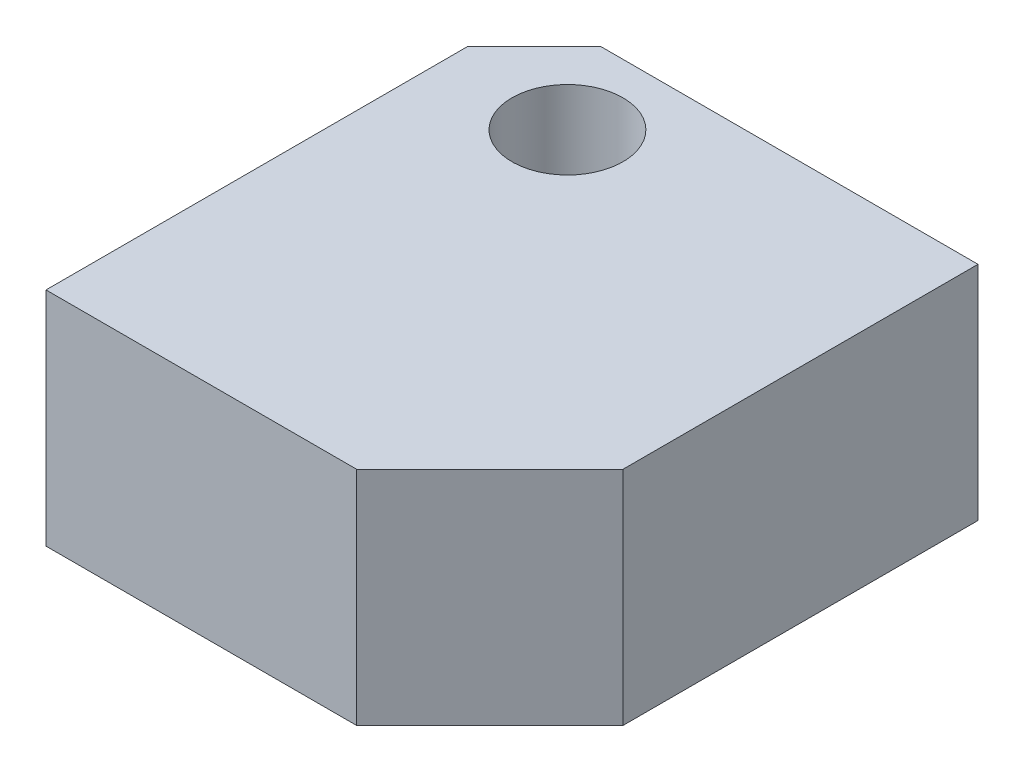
ISO-10303-21;
HEADER;
FILE_DESCRIPTION(('STEP AP214'),'2;1');
FILE_NAME('part.step','',(''),(''),'','','');
FILE_SCHEMA(('AUTOMOTIVE_DESIGN { 1 0 10303 214 1 1 1 1 }'));
ENDSEC;
DATA;
#1=APPLICATION_CONTEXT('core data for automotive mechanical design processes');
#2=APPLICATION_PROTOCOL_DEFINITION('international standard','automotive_design',2000,#1);
#3=PRODUCT_CONTEXT('',#1,'mechanical');
#4=PRODUCT('Part','Part','',(#3));
#5=PRODUCT_RELATED_PRODUCT_CATEGORY('part','',(#4));
#6=PRODUCT_DEFINITION_FORMATION('','',#4);
#7=PRODUCT_DEFINITION_CONTEXT('part definition',#1,'design');
#8=PRODUCT_DEFINITION('design','',#6,#7);
#9=PRODUCT_DEFINITION_SHAPE('','',#8);
#10=(LENGTH_UNIT() NAMED_UNIT(*) SI_UNIT(.MILLI.,.METRE.));
#11=(NAMED_UNIT(*) PLANE_ANGLE_UNIT() SI_UNIT($,.RADIAN.));
#12=(NAMED_UNIT(*) SI_UNIT($,.STERADIAN.) SOLID_ANGLE_UNIT());
#13=UNCERTAINTY_MEASURE_WITH_UNIT(LENGTH_MEASURE(1.E-05),#10,'distance_accuracy_value','');
#14=(GEOMETRIC_REPRESENTATION_CONTEXT(3) GLOBAL_UNCERTAINTY_ASSIGNED_CONTEXT((#13)) GLOBAL_UNIT_ASSIGNED_CONTEXT((#10,
#11,#12)) REPRESENTATION_CONTEXT('',''));
#15=CARTESIAN_POINT('',(0.,0.,0.));
#16=DIRECTION('',(0.,0.,1.));
#17=DIRECTION('',(1.,0.,0.));
#18=AXIS2_PLACEMENT_3D('',#15,#16,#17);
#19=CARTESIAN_POINT('',(15.5000000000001,4.99999999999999,-13.9999999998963));
#20=DIRECTION('',(0.,0.,-1.));
#21=DIRECTION('',(0.,1.,0.));
#22=AXIS2_PLACEMENT_3D('',#19,#20,#21);
#23=CONICAL_SURFACE('',#22,1.99999999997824,1.02974425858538);
#24=CARTESIAN_POINT('',(15.5000000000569,4.99999999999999,-12.7982787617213));
#25=VERTEX_POINT('',#24);
#26=VERTEX_LOOP('',#25);
#27=FACE_BOUND('',#26,.T.);
#28=CARTESIAN_POINT('',(15.5000000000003,4.99999999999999,-14.));
#29=DIRECTION('',(0.,0.,-1.));
#30=DIRECTION('',(0.,1.,0.));
#31=AXIS2_PLACEMENT_3D('',#28,#29,#30);
#32=CIRCLE('',#31,2.);
#33=CARTESIAN_POINT('',(15.5000000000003,6.99999999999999,-14.));
#34=VERTEX_POINT('',#33);
#35=EDGE_CURVE('E77',#34,#34,#32,.T.);
#36=ORIENTED_EDGE('',*,*,#35,.T.);
#37=EDGE_LOOP('',(#36));
#38=FACE_BOUND('',#37,.T.);
#39=ADVANCED_FACE('F16',(#27,#38),#23,.F.);
#40=CARTESIAN_POINT('',(15.5000000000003,4.99999999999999,-12.33819270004));
#41=DIRECTION('',(0.,0.,-1.));
#42=DIRECTION('',(0.,1.,0.));
#43=AXIS2_PLACEMENT_3D('',#40,#41,#42);
#44=CYLINDRICAL_SURFACE('',#43,2.);
#45=ORIENTED_EDGE('',*,*,#35,.F.);
#46=EDGE_LOOP('',(#45));
#47=FACE_BOUND('',#46,.T.);
#48=CARTESIAN_POINT('',(15.5000000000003,4.99999999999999,-22.));
#49=DIRECTION('',(0.,0.,-1.));
#50=DIRECTION('',(0.,1.,0.));
#51=AXIS2_PLACEMENT_3D('',#48,#49,#50);
#52=CIRCLE('',#51,2.);
#53=CARTESIAN_POINT('',(15.5000000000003,6.99999999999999,-22.));
#54=VERTEX_POINT('',#53);
#55=EDGE_CURVE('E88',#54,#54,#52,.F.);
#56=ORIENTED_EDGE('',*,*,#55,.F.);
#57=EDGE_LOOP('',(#56));
#58=FACE_BOUND('',#57,.T.);
#59=ADVANCED_FACE('F74',(#47,#58),#44,.F.);
#60=CARTESIAN_POINT('',(0.,9.99999999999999,0.));
#61=DIRECTION('',(0.,1.,0.));
#62=DIRECTION('',(-1.,0.,0.));
#63=AXIS2_PLACEMENT_3D('',#60,#61,#62);
#64=PLANE('',#63);
#65=DIRECTION('',(1.,0.,0.));
#66=VECTOR('',#65,1.);
#67=CARTESIAN_POINT('',(20.,9.99999999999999,-22.));
#68=LINE('',#67,#66);
#69=CARTESIAN_POINT('',(3.00000000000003,9.99999999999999,-22.));
#70=VERTEX_POINT('',#69);
#71=CARTESIAN_POINT('',(20.,9.99999999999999,-22.));
#72=VERTEX_POINT('',#71);
#73=EDGE_CURVE('E94',#70,#72,#68,.T.);
#74=ORIENTED_EDGE('',*,*,#73,.F.);
#75=DIRECTION('',(-0.707106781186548,0.,0.707106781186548));
#76=VECTOR('',#75,1.);
#77=CARTESIAN_POINT('',(3.,10.,-21.9999999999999));
#78=LINE('',#77,#76);
#79=CARTESIAN_POINT('',(2.91433543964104E-13,9.99999999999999,-18.9999999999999));
#80=VERTEX_POINT('',#79);
#81=EDGE_CURVE('E87',#80,#70,#78,.F.);
#82=ORIENTED_EDGE('',*,*,#81,.F.);
#83=DIRECTION('',(0.,0.,1.));
#84=VECTOR('',#83,1.);
#85=CARTESIAN_POINT('',(3.33066907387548E-13,9.99999999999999,-18.9999999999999));
#86=LINE('',#85,#84);
#87=CARTESIAN_POINT('',(2.49800180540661E-13,9.99999999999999,0.));
#88=VERTEX_POINT('',#87);
#89=EDGE_CURVE('E68',#88,#80,#86,.F.);
#90=ORIENTED_EDGE('',*,*,#89,.F.);
#91=DIRECTION('',(1.,0.,0.));
#92=VECTOR('',#91,1.);
#93=CARTESIAN_POINT('',(0.,9.99999999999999,0.));
#94=LINE('',#93,#92);
#95=CARTESIAN_POINT('',(13.9999999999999,9.99999999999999,0.));
#96=VERTEX_POINT('',#95);
#97=EDGE_CURVE('E110',#96,#88,#94,.F.);
#98=ORIENTED_EDGE('',*,*,#97,.F.);
#99=DIRECTION('',(0.707106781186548,0.,-0.707106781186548));
#100=VECTOR('',#99,1.);
#101=CARTESIAN_POINT('',(13.9999999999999,10.,0.));
#102=LINE('',#101,#100);
#103=CARTESIAN_POINT('',(20.,10.,-6.00000000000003));
#104=VERTEX_POINT('',#103);
#105=EDGE_CURVE('E102',#104,#96,#102,.F.);
#106=ORIENTED_EDGE('',*,*,#105,.F.);
#107=DIRECTION('',(0.,0.,1.));
#108=VECTOR('',#107,1.);
#109=CARTESIAN_POINT('',(20.,9.99999999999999,-6.00000000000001));
#110=LINE('',#109,#108);
#111=EDGE_CURVE('E91',#72,#104,#110,.T.);
#112=ORIENTED_EDGE('',*,*,#111,.F.);
#113=EDGE_LOOP('',(#74,#82,#90,#98,#106,#112));
#114=FACE_BOUND('',#113,.T.);
#115=CARTESIAN_POINT('',(5.49999999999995,9.99999999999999,-18.));
#116=DIRECTION('',(0.,1.,0.));
#117=DIRECTION('',(-1.,0.,0.));
#118=AXIS2_PLACEMENT_3D('',#115,#116,#117);
#119=CIRCLE('',#118,2.5);
#120=CARTESIAN_POINT('',(2.99999999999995,9.99999999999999,-18.));
#121=VERTEX_POINT('',#120);
#122=EDGE_CURVE('E19',#121,#121,#119,.F.);
#123=ORIENTED_EDGE('',*,*,#122,.T.);
#124=EDGE_LOOP('',(#123));
#125=FACE_BOUND('',#124,.T.);
#126=ADVANCED_FACE('F124',(#114,#125),#64,.T.);
#127=CARTESIAN_POINT('',(5.49999999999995,0.,-18.));
#128=DIRECTION('',(0.,1.,0.));
#129=DIRECTION('',(-1.,0.,0.));
#130=AXIS2_PLACEMENT_3D('',#127,#128,#129);
#131=CYLINDRICAL_SURFACE('',#130,2.5);
#132=CARTESIAN_POINT('',(5.49999999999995,0.,-18.));
#133=DIRECTION('',(0.,1.,0.));
#134=DIRECTION('',(-1.,0.,0.));
#135=AXIS2_PLACEMENT_3D('',#132,#133,#134);
#136=CIRCLE('',#135,2.5);
#137=CARTESIAN_POINT('',(2.99999999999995,0.,-18.));
#138=VERTEX_POINT('',#137);
#139=EDGE_CURVE('E84',#138,#138,#136,.F.);
#140=ORIENTED_EDGE('',*,*,#139,.T.);
#141=EDGE_LOOP('',(#140));
#142=FACE_BOUND('',#141,.T.);
#143=ORIENTED_EDGE('',*,*,#122,.F.);
#144=EDGE_LOOP('',(#143));
#145=FACE_BOUND('',#144,.T.);
#146=ADVANCED_FACE('F161',(#142,#145),#131,.F.);
#147=CARTESIAN_POINT('',(3.33066907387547E-13,0.,-18.9999999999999));
#148=DIRECTION('',(-1.,0.,0.));
#149=DIRECTION('',(0.,-1.,0.));
#150=AXIS2_PLACEMENT_3D('',#147,#148,#149);
#151=PLANE('',#150);
#152=DIRECTION('',(0.,-1.,0.));
#153=VECTOR('',#152,1.);
#154=CARTESIAN_POINT('',(0.,0.,0.));
#155=LINE('',#154,#153);
#156=CARTESIAN_POINT('',(2.4980018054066E-13,0.,0.));
#157=VERTEX_POINT('',#156);
#158=EDGE_CURVE('E111',#88,#157,#155,.T.);
#159=ORIENTED_EDGE('',*,*,#158,.F.);
#160=ORIENTED_EDGE('',*,*,#89,.T.);
#161=DIRECTION('',(0.,1.,0.));
#162=VECTOR('',#161,1.);
#163=CARTESIAN_POINT('',(1.66533453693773E-13,0.,-19.0000000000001));
#164=LINE('',#163,#162);
#165=CARTESIAN_POINT('',(2.91596174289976E-13,0.,-18.9999999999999));
#166=VERTEX_POINT('',#165);
#167=EDGE_CURVE('E121',#166,#80,#164,.T.);
#168=ORIENTED_EDGE('',*,*,#167,.F.);
#169=DIRECTION('',(0.,0.,1.));
#170=VECTOR('',#169,1.);
#171=CARTESIAN_POINT('',(3.33066907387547E-13,0.,0.));
#172=LINE('',#171,#170);
#173=EDGE_CURVE('E86',#166,#157,#172,.T.);
#174=ORIENTED_EDGE('',*,*,#173,.T.);
#175=EDGE_LOOP('',(#159,#160,#168,#174));
#176=FACE_BOUND('',#175,.T.);
#177=ADVANCED_FACE('F119',(#176),#151,.T.);
#178=CARTESIAN_POINT('',(0.,0.,0.));
#179=DIRECTION('',(0.,0.,1.));
#180=DIRECTION('',(0.,-1.,0.));
#181=AXIS2_PLACEMENT_3D('',#178,#179,#180);
#182=PLANE('',#181);
#183=DIRECTION('',(0.,1.,0.));
#184=VECTOR('',#183,1.);
#185=CARTESIAN_POINT('',(13.9999999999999,0.,0.));
#186=LINE('',#185,#184);
#187=CARTESIAN_POINT('',(13.9999999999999,0.,0.));
#188=VERTEX_POINT('',#187);
#189=EDGE_CURVE('E108',#96,#188,#186,.F.);
#190=ORIENTED_EDGE('',*,*,#189,.F.);
#191=ORIENTED_EDGE('',*,*,#97,.T.);
#192=ORIENTED_EDGE('',*,*,#158,.T.);
#193=DIRECTION('',(-1.,0.,0.));
#194=VECTOR('',#193,1.);
#195=CARTESIAN_POINT('',(0.,0.,0.));
#196=LINE('',#195,#194);
#197=EDGE_CURVE('E145',#157,#188,#196,.F.);
#198=ORIENTED_EDGE('',*,*,#197,.T.);
#199=EDGE_LOOP('',(#190,#191,#192,#198));
#200=FACE_BOUND('',#199,.T.);
#201=ADVANCED_FACE('F152',(#200),#182,.T.);
#202=CARTESIAN_POINT('',(13.9999999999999,0.,0.));
#203=DIRECTION('',(0.707106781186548,0.,0.707106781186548));
#204=DIRECTION('',(0.707106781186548,0.,-0.707106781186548));
#205=AXIS2_PLACEMENT_3D('',#202,#203,#204);
#206=PLANE('',#205);
#207=DIRECTION('',(0.,1.,0.));
#208=VECTOR('',#207,1.);
#209=CARTESIAN_POINT('',(20.,0.,-6.00000000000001));
#210=LINE('',#209,#208);
#211=CARTESIAN_POINT('',(20.,0.,-6.00000000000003));
#212=VERTEX_POINT('',#211);
#213=EDGE_CURVE('E97',#104,#212,#210,.F.);
#214=ORIENTED_EDGE('',*,*,#213,.F.);
#215=ORIENTED_EDGE('',*,*,#105,.T.);
#216=ORIENTED_EDGE('',*,*,#189,.T.);
#217=DIRECTION('',(0.707106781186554,0.,-0.707106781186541));
#218=VECTOR('',#217,1.);
#219=CARTESIAN_POINT('',(13.9999999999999,0.,0.));
#220=LINE('',#219,#218);
#221=EDGE_CURVE('E142',#188,#212,#220,.T.);
#222=ORIENTED_EDGE('',*,*,#221,.T.);
#223=EDGE_LOOP('',(#214,#215,#216,#222));
#224=FACE_BOUND('',#223,.T.);
#225=ADVANCED_FACE('F151',(#224),#206,.T.);
#226=CARTESIAN_POINT('',(20.,0.,-6.00000000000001));
#227=DIRECTION('',(1.,0.,0.));
#228=DIRECTION('',(0.,1.,0.));
#229=AXIS2_PLACEMENT_3D('',#226,#227,#228);
#230=PLANE('',#229);
#231=DIRECTION('',(0.,1.,0.));
#232=VECTOR('',#231,1.);
#233=CARTESIAN_POINT('',(20.,0.,-22.));
#234=LINE('',#233,#232);
#235=CARTESIAN_POINT('',(20.,0.,-22.));
#236=VERTEX_POINT('',#235);
#237=EDGE_CURVE('E90',#72,#236,#234,.F.);
#238=ORIENTED_EDGE('',*,*,#237,.F.);
#239=ORIENTED_EDGE('',*,*,#111,.T.);
#240=ORIENTED_EDGE('',*,*,#213,.T.);
#241=DIRECTION('',(0.,0.,1.));
#242=VECTOR('',#241,1.);
#243=CARTESIAN_POINT('',(20.,0.,0.));
#244=LINE('',#243,#242);
#245=EDGE_CURVE('E138',#212,#236,#244,.F.);
#246=ORIENTED_EDGE('',*,*,#245,.T.);
#247=EDGE_LOOP('',(#238,#239,#240,#246));
#248=FACE_BOUND('',#247,.T.);
#249=ADVANCED_FACE('F136',(#248),#230,.T.);
#250=CARTESIAN_POINT('',(20.,0.,-22.));
#251=DIRECTION('',(0.,0.,-1.));
#252=DIRECTION('',(0.,1.,0.));
#253=AXIS2_PLACEMENT_3D('',#250,#251,#252);
#254=PLANE('',#253);
#255=DIRECTION('',(0.,1.,0.));
#256=VECTOR('',#255,1.);
#257=CARTESIAN_POINT('',(3.,0.,-21.9999999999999));
#258=LINE('',#257,#256);
#259=CARTESIAN_POINT('',(3.00000000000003,0.,-22.));
#260=VERTEX_POINT('',#259);
#261=EDGE_CURVE('E33',#70,#260,#258,.F.);
#262=ORIENTED_EDGE('',*,*,#261,.F.);
#263=ORIENTED_EDGE('',*,*,#73,.T.);
#264=ORIENTED_EDGE('',*,*,#237,.T.);
#265=DIRECTION('',(-1.,0.,0.));
#266=VECTOR('',#265,1.);
#267=CARTESIAN_POINT('',(0.,0.,-22.));
#268=LINE('',#267,#266);
#269=EDGE_CURVE('E25',#236,#260,#268,.T.);
#270=ORIENTED_EDGE('',*,*,#269,.T.);
#271=EDGE_LOOP('',(#262,#263,#264,#270));
#272=FACE_BOUND('',#271,.T.);
#273=ORIENTED_EDGE('',*,*,#55,.T.);
#274=EDGE_LOOP('',(#273));
#275=FACE_BOUND('',#274,.T.);
#276=ADVANCED_FACE('F132',(#272,#275),#254,.T.);
#277=CARTESIAN_POINT('',(3.,0.,-21.9999999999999));
#278=DIRECTION('',(-0.707106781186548,0.,-0.707106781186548));
#279=DIRECTION('',(-0.707106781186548,0.,0.707106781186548));
#280=AXIS2_PLACEMENT_3D('',#277,#278,#279);
#281=PLANE('',#280);
#282=ORIENTED_EDGE('',*,*,#167,.T.);
#283=ORIENTED_EDGE('',*,*,#81,.T.);
#284=ORIENTED_EDGE('',*,*,#261,.T.);
#285=DIRECTION('',(-0.707106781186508,0.,0.707106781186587));
#286=VECTOR('',#285,1.);
#287=CARTESIAN_POINT('',(3.,0.,-21.9999999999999));
#288=LINE('',#287,#286);
#289=EDGE_CURVE('E11',#260,#166,#288,.T.);
#290=ORIENTED_EDGE('',*,*,#289,.T.);
#291=EDGE_LOOP('',(#282,#283,#284,#290));
#292=FACE_BOUND('',#291,.T.);
#293=ADVANCED_FACE('F122',(#292),#281,.T.);
#294=CARTESIAN_POINT('',(0.,0.,0.));
#295=DIRECTION('',(0.,1.,0.));
#296=DIRECTION('',(-1.,0.,0.));
#297=AXIS2_PLACEMENT_3D('',#294,#295,#296);
#298=PLANE('',#297);
#299=ORIENTED_EDGE('',*,*,#269,.F.);
#300=ORIENTED_EDGE('',*,*,#245,.F.);
#301=ORIENTED_EDGE('',*,*,#221,.F.);
#302=ORIENTED_EDGE('',*,*,#197,.F.);
#303=ORIENTED_EDGE('',*,*,#173,.F.);
#304=ORIENTED_EDGE('',*,*,#289,.F.);
#305=EDGE_LOOP('',(#299,#300,#301,#302,#303,#304));
#306=FACE_BOUND('',#305,.T.);
#307=ORIENTED_EDGE('',*,*,#139,.F.);
#308=EDGE_LOOP('',(#307));
#309=FACE_BOUND('',#308,.T.);
#310=ADVANCED_FACE('F148',(#306,#309),#298,.F.);
#311=CLOSED_SHELL('',(#39,#59,#126,#146,#177,#201,#225,#249,#276,#293,#310));
#312=MANIFOLD_SOLID_BREP('B1',#311);
#313=ADVANCED_BREP_SHAPE_REPRESENTATION('',(#18,#312),#14);
#314=SHAPE_DEFINITION_REPRESENTATION(#9,#313);
ENDSEC;
END-ISO-10303-21;
